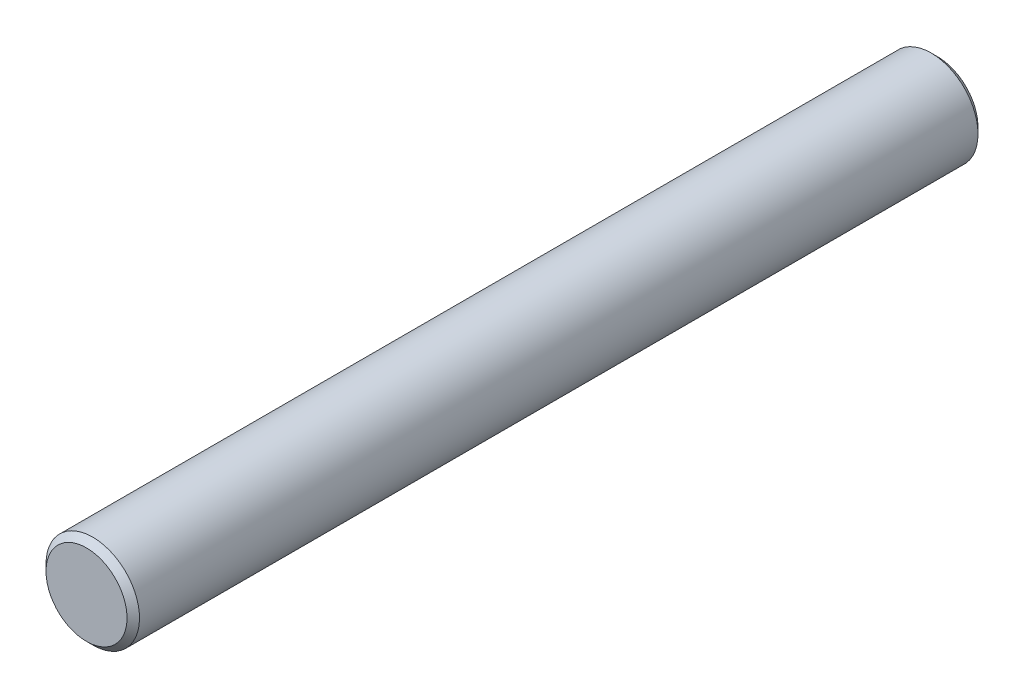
ISO-10303-21;
HEADER;
FILE_DESCRIPTION(('STEP AP214'),'2;1');
FILE_NAME('part.step','',(''),(''),'','','');
FILE_SCHEMA(('AUTOMOTIVE_DESIGN { 1 0 10303 214 1 1 1 1 }'));
ENDSEC;
DATA;
#1=APPLICATION_CONTEXT('core data for automotive mechanical design processes');
#2=APPLICATION_PROTOCOL_DEFINITION('international standard','automotive_design',2000,#1);
#3=PRODUCT_CONTEXT('',#1,'mechanical');
#4=PRODUCT('Part','Part','',(#3));
#5=PRODUCT_RELATED_PRODUCT_CATEGORY('part','',(#4));
#6=PRODUCT_DEFINITION_FORMATION('','',#4);
#7=PRODUCT_DEFINITION_CONTEXT('part definition',#1,'design');
#8=PRODUCT_DEFINITION('design','',#6,#7);
#9=PRODUCT_DEFINITION_SHAPE('','',#8);
#10=(LENGTH_UNIT() NAMED_UNIT(*) SI_UNIT(.MILLI.,.METRE.));
#11=(NAMED_UNIT(*) PLANE_ANGLE_UNIT() SI_UNIT($,.RADIAN.));
#12=(NAMED_UNIT(*) SI_UNIT($,.STERADIAN.) SOLID_ANGLE_UNIT());
#13=UNCERTAINTY_MEASURE_WITH_UNIT(LENGTH_MEASURE(1.E-05),#10,'distance_accuracy_value','');
#14=(GEOMETRIC_REPRESENTATION_CONTEXT(3) GLOBAL_UNCERTAINTY_ASSIGNED_CONTEXT((#13)) GLOBAL_UNIT_ASSIGNED_CONTEXT((#10,
#11,#12)) REPRESENTATION_CONTEXT('',''));
#15=CARTESIAN_POINT('',(0.,0.,0.));
#16=DIRECTION('',(0.,0.,1.));
#17=DIRECTION('',(1.,0.,0.));
#18=AXIS2_PLACEMENT_3D('',#15,#16,#17);
#19=CARTESIAN_POINT('',(0.,0.,27.3));
#20=DIRECTION('',(0.,0.,1.));
#21=DIRECTION('',(0.,-1.,0.));
#22=AXIS2_PLACEMENT_3D('',#19,#20,#21);
#23=PLANE('',#22);
#24=CARTESIAN_POINT('',(0.,0.,27.3000000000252));
#25=DIRECTION('',(0.,0.,-1.));
#26=DIRECTION('',(-1.,0.,0.));
#27=AXIS2_PLACEMENT_3D('',#24,#25,#26);
#28=CIRCLE('',#27,1.30000000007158);
#29=CARTESIAN_POINT('',(-1.30000000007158,0.,27.3000000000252));
#30=VERTEX_POINT('',#29);
#31=EDGE_CURVE('E17',#30,#30,#28,.T.);
#32=ORIENTED_EDGE('',*,*,#31,.F.);
#33=EDGE_LOOP('',(#32));
#34=FACE_BOUND('',#33,.T.);
#35=ADVANCED_FACE('F14',(#34),#23,.T.);
#36=CARTESIAN_POINT('',(0.,0.,0.));
#37=DIRECTION('',(0.,0.,1.));
#38=DIRECTION('',(0.,-1.,0.));
#39=AXIS2_PLACEMENT_3D('',#36,#37,#38);
#40=PLANE('',#39);
#41=CARTESIAN_POINT('',(0.,0.,5.68434730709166E-11));
#42=DIRECTION('',(0.,0.,1.));
#43=DIRECTION('',(0.,-1.,0.));
#44=AXIS2_PLACEMENT_3D('',#41,#42,#43);
#45=CIRCLE('',#44,1.30000000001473);
#46=CARTESIAN_POINT('',(0.,-1.30000000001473,5.68433321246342E-11));
#47=VERTEX_POINT('',#46);
#48=EDGE_CURVE('E26',#47,#47,#45,.T.);
#49=ORIENTED_EDGE('',*,*,#48,.F.);
#50=EDGE_LOOP('',(#49));
#51=FACE_BOUND('',#50,.T.);
#52=ADVANCED_FACE('F37',(#51),#40,.F.);
#53=CARTESIAN_POINT('',(0.,0.,27.1000000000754));
#54=DIRECTION('',(0.,0.,-1.));
#55=DIRECTION('',(-1.,0.,0.));
#56=AXIS2_PLACEMENT_3D('',#53,#54,#55);
#57=CONICAL_SURFACE('',#56,1.50000000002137,0.785398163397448);
#58=CARTESIAN_POINT('',(0.,0.,27.1));
#59=DIRECTION('',(0.,0.,-1.));
#60=DIRECTION('',(0.,1.,0.));
#61=AXIS2_PLACEMENT_3D('',#58,#59,#60);
#62=CIRCLE('',#61,1.5);
#63=CARTESIAN_POINT('',(0.,1.5,27.1));
#64=VERTEX_POINT('',#63);
#65=EDGE_CURVE('E21',#64,#64,#62,.T.);
#66=ORIENTED_EDGE('',*,*,#65,.F.);
#67=EDGE_LOOP('',(#66));
#68=FACE_BOUND('',#67,.T.);
#69=ORIENTED_EDGE('',*,*,#31,.T.);
#70=EDGE_LOOP('',(#69));
#71=FACE_BOUND('',#70,.T.);
#72=ADVANCED_FACE('F34',(#68,#71),#57,.T.);
#73=CARTESIAN_POINT('',(0.,0.,0.199999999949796));
#74=DIRECTION('',(0.,0.,1.));
#75=DIRECTION('',(0.,-1.,0.));
#76=AXIS2_PLACEMENT_3D('',#73,#74,#75);
#77=CONICAL_SURFACE('',#76,1.49999999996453,0.785398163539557);
#78=CARTESIAN_POINT('',(0.,0.,0.199999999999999));
#79=DIRECTION('',(0.,0.,-1.));
#80=DIRECTION('',(0.,1.,0.));
#81=AXIS2_PLACEMENT_3D('',#78,#79,#80);
#82=CIRCLE('',#81,1.5);
#83=CARTESIAN_POINT('',(0.,1.5,0.199999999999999));
#84=VERTEX_POINT('',#83);
#85=EDGE_CURVE('E10',#84,#84,#82,.F.);
#86=ORIENTED_EDGE('',*,*,#85,.F.);
#87=EDGE_LOOP('',(#86));
#88=FACE_BOUND('',#87,.T.);
#89=ORIENTED_EDGE('',*,*,#48,.T.);
#90=EDGE_LOOP('',(#89));
#91=FACE_BOUND('',#90,.T.);
#92=ADVANCED_FACE('F45',(#88,#91),#77,.T.);
#93=CARTESIAN_POINT('',(0.,0.,27.3));
#94=DIRECTION('',(0.,0.,-1.));
#95=DIRECTION('',(0.,1.,0.));
#96=AXIS2_PLACEMENT_3D('',#93,#94,#95);
#97=CYLINDRICAL_SURFACE('',#96,1.5);
#98=ORIENTED_EDGE('',*,*,#85,.T.);
#99=EDGE_LOOP('',(#98));
#100=FACE_BOUND('',#99,.T.);
#101=ORIENTED_EDGE('',*,*,#65,.T.);
#102=EDGE_LOOP('',(#101));
#103=FACE_BOUND('',#102,.T.);
#104=ADVANCED_FACE('F43',(#100,#103),#97,.T.);
#105=CLOSED_SHELL('',(#35,#52,#72,#92,#104));
#106=MANIFOLD_SOLID_BREP('B1',#105);
#107=ADVANCED_BREP_SHAPE_REPRESENTATION('',(#18,#106),#14);
#108=SHAPE_DEFINITION_REPRESENTATION(#9,#107);
ENDSEC;
END-ISO-10303-21;
